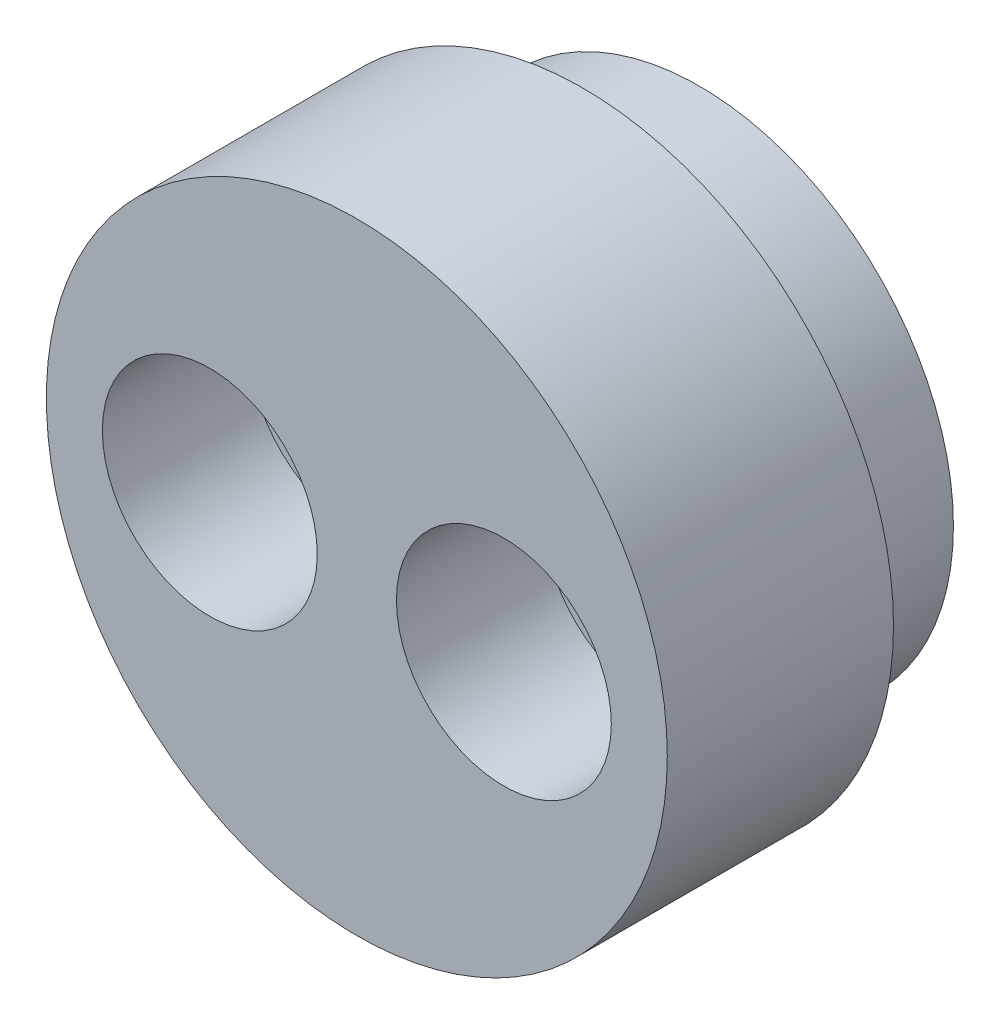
ISO-10303-21;
HEADER;
FILE_DESCRIPTION(('STEP AP214'),'2;1');
FILE_NAME('part.step','',(''),(''),'','','');
FILE_SCHEMA(('AUTOMOTIVE_DESIGN { 1 0 10303 214 1 1 1 1 }'));
ENDSEC;
DATA;
#1=APPLICATION_CONTEXT('core data for automotive mechanical design processes');
#2=APPLICATION_PROTOCOL_DEFINITION('international standard','automotive_design',2000,#1);
#3=PRODUCT_CONTEXT('',#1,'mechanical');
#4=PRODUCT('Part','Part','',(#3));
#5=PRODUCT_RELATED_PRODUCT_CATEGORY('part','',(#4));
#6=PRODUCT_DEFINITION_FORMATION('','',#4);
#7=PRODUCT_DEFINITION_CONTEXT('part definition',#1,'design');
#8=PRODUCT_DEFINITION('design','',#6,#7);
#9=PRODUCT_DEFINITION_SHAPE('','',#8);
#10=(LENGTH_UNIT() NAMED_UNIT(*) SI_UNIT(.MILLI.,.METRE.));
#11=(NAMED_UNIT(*) PLANE_ANGLE_UNIT() SI_UNIT($,.RADIAN.));
#12=(NAMED_UNIT(*) SI_UNIT($,.STERADIAN.) SOLID_ANGLE_UNIT());
#13=UNCERTAINTY_MEASURE_WITH_UNIT(LENGTH_MEASURE(1.E-05),#10,'distance_accuracy_value','');
#14=(GEOMETRIC_REPRESENTATION_CONTEXT(3) GLOBAL_UNCERTAINTY_ASSIGNED_CONTEXT((#13)) GLOBAL_UNIT_ASSIGNED_CONTEXT((#10,
#11,#12)) REPRESENTATION_CONTEXT('',''));
#15=CARTESIAN_POINT('',(0.,0.,0.));
#16=DIRECTION('',(0.,0.,1.));
#17=DIRECTION('',(1.,0.,0.));
#18=AXIS2_PLACEMENT_3D('',#15,#16,#17);
#19=CARTESIAN_POINT('',(0.,0.,10.3));
#20=DIRECTION('',(0.,0.,1.));
#21=DIRECTION('',(1.,0.,0.));
#22=AXIS2_PLACEMENT_3D('',#19,#20,#21);
#23=CYLINDRICAL_SURFACE('',#22,27.45);
#24=CARTESIAN_POINT('',(0.,0.,30.3));
#25=DIRECTION('',(0.,0.,1.));
#26=DIRECTION('',(1.,0.,0.));
#27=AXIS2_PLACEMENT_3D('',#24,#25,#26);
#28=CIRCLE('',#27,27.45);
#29=CARTESIAN_POINT('',(27.45,0.,30.3));
#30=VERTEX_POINT('',#29);
#31=EDGE_CURVE('E48',#30,#30,#28,.F.);
#32=ORIENTED_EDGE('',*,*,#31,.T.);
#33=EDGE_LOOP('',(#32));
#34=FACE_BOUND('',#33,.T.);
#35=CARTESIAN_POINT('',(0.,0.,10.3));
#36=DIRECTION('',(0.,0.,1.));
#37=DIRECTION('',(1.,0.,0.));
#38=AXIS2_PLACEMENT_3D('',#35,#36,#37);
#39=CIRCLE('',#38,27.45);
#40=CARTESIAN_POINT('',(27.45,0.,10.3));
#41=VERTEX_POINT('',#40);
#42=EDGE_CURVE('E16',#41,#41,#39,.T.);
#43=ORIENTED_EDGE('',*,*,#42,.T.);
#44=EDGE_LOOP('',(#43));
#45=FACE_BOUND('',#44,.T.);
#46=ADVANCED_FACE('F12',(#34,#45),#23,.T.);
#47=CARTESIAN_POINT('',(-13.,0.,17.3));
#48=DIRECTION('',(0.,0.,1.));
#49=DIRECTION('',(1.,0.,0.));
#50=AXIS2_PLACEMENT_3D('',#47,#48,#49);
#51=CYLINDRICAL_SURFACE('',#50,9.5);
#52=CARTESIAN_POINT('',(-13.,0.,17.3));
#53=DIRECTION('',(0.,0.,1.));
#54=DIRECTION('',(1.,0.,0.));
#55=AXIS2_PLACEMENT_3D('',#52,#53,#54);
#56=CIRCLE('',#55,9.5);
#57=CARTESIAN_POINT('',(-3.5,0.,17.3));
#58=VERTEX_POINT('',#57);
#59=EDGE_CURVE('E50',#58,#58,#56,.F.);
#60=ORIENTED_EDGE('',*,*,#59,.T.);
#61=EDGE_LOOP('',(#60));
#62=FACE_BOUND('',#61,.T.);
#63=CARTESIAN_POINT('',(-13.,0.,30.3));
#64=DIRECTION('',(0.,0.,1.));
#65=DIRECTION('',(1.,0.,0.));
#66=AXIS2_PLACEMENT_3D('',#63,#64,#65);
#67=CIRCLE('',#66,9.5);
#68=CARTESIAN_POINT('',(-3.5,0.,30.3));
#69=VERTEX_POINT('',#68);
#70=EDGE_CURVE('E45',#69,#69,#67,.T.);
#71=ORIENTED_EDGE('',*,*,#70,.T.);
#72=EDGE_LOOP('',(#71));
#73=FACE_BOUND('',#72,.T.);
#74=ADVANCED_FACE('F61',(#62,#73),#51,.F.);
#75=CARTESIAN_POINT('',(-27.7794,27.7794,10.3));
#76=DIRECTION('',(0.,0.,1.));
#77=DIRECTION('',(0.,-1.,0.));
#78=AXIS2_PLACEMENT_3D('',#75,#76,#77);
#79=PLANE('',#78);
#80=CARTESIAN_POINT('',(0.,0.,10.3));
#81=DIRECTION('',(0.,0.,1.));
#82=DIRECTION('',(1.,0.,0.));
#83=AXIS2_PLACEMENT_3D('',#80,#81,#82);
#84=CIRCLE('',#83,22.45);
#85=CARTESIAN_POINT('',(22.45,0.,10.3));
#86=VERTEX_POINT('',#85);
#87=EDGE_CURVE('E42',#86,#86,#84,.T.);
#88=ORIENTED_EDGE('',*,*,#87,.T.);
#89=EDGE_LOOP('',(#88));
#90=FACE_BOUND('',#89,.T.);
#91=ORIENTED_EDGE('',*,*,#42,.F.);
#92=EDGE_LOOP('',(#91));
#93=FACE_BOUND('',#92,.T.);
#94=ADVANCED_FACE('F58',(#90,#93),#79,.F.);
#95=CARTESIAN_POINT('',(-3.386,-9.614,17.3));
#96=DIRECTION('',(0.,0.,-1.));
#97=DIRECTION('',(-1.,0.,0.));
#98=AXIS2_PLACEMENT_3D('',#95,#96,#97);
#99=PLANE('',#98);
#100=CARTESIAN_POINT('',(-13.,0.,17.3));
#101=DIRECTION('',(0.,0.,1.));
#102=DIRECTION('',(1.,0.,0.));
#103=AXIS2_PLACEMENT_3D('',#100,#101,#102);
#104=CIRCLE('',#103,6.25);
#105=CARTESIAN_POINT('',(-6.75,0.,17.3));
#106=VERTEX_POINT('',#105);
#107=EDGE_CURVE('E39',#106,#106,#104,.T.);
#108=ORIENTED_EDGE('',*,*,#107,.F.);
#109=EDGE_LOOP('',(#108));
#110=FACE_BOUND('',#109,.T.);
#111=ORIENTED_EDGE('',*,*,#59,.F.);
#112=EDGE_LOOP('',(#111));
#113=FACE_BOUND('',#112,.T.);
#114=ADVANCED_FACE('F60',(#110,#113),#99,.F.);
#115=CARTESIAN_POINT('',(-27.7794,-27.7794,30.3));
#116=DIRECTION('',(0.,0.,-1.));
#117=DIRECTION('',(0.,1.,0.));
#118=AXIS2_PLACEMENT_3D('',#115,#116,#117);
#119=PLANE('',#118);
#120=ORIENTED_EDGE('',*,*,#70,.F.);
#121=EDGE_LOOP('',(#120));
#122=FACE_BOUND('',#121,.T.);
#123=CARTESIAN_POINT('',(13.,0.,30.3));
#124=DIRECTION('',(0.,0.,1.));
#125=DIRECTION('',(1.,0.,0.));
#126=AXIS2_PLACEMENT_3D('',#123,#124,#125);
#127=CIRCLE('',#126,9.5);
#128=CARTESIAN_POINT('',(22.5,0.,30.3));
#129=VERTEX_POINT('',#128);
#130=EDGE_CURVE('E36',#129,#129,#127,.T.);
#131=ORIENTED_EDGE('',*,*,#130,.F.);
#132=EDGE_LOOP('',(#131));
#133=FACE_BOUND('',#132,.T.);
#134=ORIENTED_EDGE('',*,*,#31,.F.);
#135=EDGE_LOOP('',(#134));
#136=FACE_BOUND('',#135,.T.);
#137=ADVANCED_FACE('F70',(#122,#133,#136),#119,.F.);
#138=CARTESIAN_POINT('',(0.,0.,0.));
#139=DIRECTION('',(0.,0.,1.));
#140=DIRECTION('',(1.,0.,0.));
#141=AXIS2_PLACEMENT_3D('',#138,#139,#140);
#142=CYLINDRICAL_SURFACE('',#141,22.45);
#143=ORIENTED_EDGE('',*,*,#87,.F.);
#144=EDGE_LOOP('',(#143));
#145=FACE_BOUND('',#144,.T.);
#146=CARTESIAN_POINT('',(0.,0.,0.));
#147=DIRECTION('',(0.,0.,1.));
#148=DIRECTION('',(1.,0.,0.));
#149=AXIS2_PLACEMENT_3D('',#146,#147,#148);
#150=CIRCLE('',#149,22.45);
#151=CARTESIAN_POINT('',(22.45,0.,0.));
#152=VERTEX_POINT('',#151);
#153=EDGE_CURVE('E33',#152,#152,#150,.T.);
#154=ORIENTED_EDGE('',*,*,#153,.T.);
#155=EDGE_LOOP('',(#154));
#156=FACE_BOUND('',#155,.T.);
#157=ADVANCED_FACE('F92',(#145,#156),#142,.T.);
#158=CARTESIAN_POINT('',(-13.,0.,0.));
#159=DIRECTION('',(0.,0.,1.));
#160=DIRECTION('',(1.,0.,0.));
#161=AXIS2_PLACEMENT_3D('',#158,#159,#160);
#162=CYLINDRICAL_SURFACE('',#161,6.25);
#163=CARTESIAN_POINT('',(-13.,0.,0.));
#164=DIRECTION('',(0.,0.,1.));
#165=DIRECTION('',(1.,0.,0.));
#166=AXIS2_PLACEMENT_3D('',#163,#164,#165);
#167=CIRCLE('',#166,6.25);
#168=CARTESIAN_POINT('',(-6.75,0.,0.));
#169=VERTEX_POINT('',#168);
#170=EDGE_CURVE('E30',#169,#169,#167,.F.);
#171=ORIENTED_EDGE('',*,*,#170,.T.);
#172=EDGE_LOOP('',(#171));
#173=FACE_BOUND('',#172,.T.);
#174=ORIENTED_EDGE('',*,*,#107,.T.);
#175=EDGE_LOOP('',(#174));
#176=FACE_BOUND('',#175,.T.);
#177=ADVANCED_FACE('F88',(#173,#176),#162,.F.);
#178=CARTESIAN_POINT('',(13.,0.,17.3));
#179=DIRECTION('',(0.,0.,1.));
#180=DIRECTION('',(1.,0.,0.));
#181=AXIS2_PLACEMENT_3D('',#178,#179,#180);
#182=CYLINDRICAL_SURFACE('',#181,9.5);
#183=CARTESIAN_POINT('',(13.,0.,17.3));
#184=DIRECTION('',(0.,0.,1.));
#185=DIRECTION('',(1.,0.,0.));
#186=AXIS2_PLACEMENT_3D('',#183,#184,#185);
#187=CIRCLE('',#186,9.5);
#188=CARTESIAN_POINT('',(22.5,0.,17.3));
#189=VERTEX_POINT('',#188);
#190=EDGE_CURVE('E25',#189,#189,#187,.F.);
#191=ORIENTED_EDGE('',*,*,#190,.T.);
#192=EDGE_LOOP('',(#191));
#193=FACE_BOUND('',#192,.T.);
#194=ORIENTED_EDGE('',*,*,#130,.T.);
#195=EDGE_LOOP('',(#194));
#196=FACE_BOUND('',#195,.T.);
#197=ADVANCED_FACE('F85',(#193,#196),#182,.F.);
#198=CARTESIAN_POINT('',(-22.7194,22.7194,0.));
#199=DIRECTION('',(0.,0.,1.));
#200=DIRECTION('',(0.,-1.,0.));
#201=AXIS2_PLACEMENT_3D('',#198,#199,#200);
#202=PLANE('',#201);
#203=ORIENTED_EDGE('',*,*,#170,.F.);
#204=EDGE_LOOP('',(#203));
#205=FACE_BOUND('',#204,.T.);
#206=CARTESIAN_POINT('',(13.,0.,0.));
#207=DIRECTION('',(0.,0.,1.));
#208=DIRECTION('',(1.,0.,0.));
#209=AXIS2_PLACEMENT_3D('',#206,#207,#208);
#210=CIRCLE('',#209,6.25);
#211=CARTESIAN_POINT('',(19.25,0.,0.));
#212=VERTEX_POINT('',#211);
#213=EDGE_CURVE('E20',#212,#212,#210,.F.);
#214=ORIENTED_EDGE('',*,*,#213,.F.);
#215=EDGE_LOOP('',(#214));
#216=FACE_BOUND('',#215,.T.);
#217=ORIENTED_EDGE('',*,*,#153,.F.);
#218=EDGE_LOOP('',(#217));
#219=FACE_BOUND('',#218,.T.);
#220=ADVANCED_FACE('F81',(#205,#216,#219),#202,.F.);
#221=CARTESIAN_POINT('',(22.614,-9.614,17.3));
#222=DIRECTION('',(0.,0.,-1.));
#223=DIRECTION('',(-1.,0.,0.));
#224=AXIS2_PLACEMENT_3D('',#221,#222,#223);
#225=PLANE('',#224);
#226=CARTESIAN_POINT('',(13.,0.,17.3));
#227=DIRECTION('',(0.,0.,1.));
#228=DIRECTION('',(1.,0.,0.));
#229=AXIS2_PLACEMENT_3D('',#226,#227,#228);
#230=CIRCLE('',#229,6.25);
#231=CARTESIAN_POINT('',(19.25,0.,17.3));
#232=VERTEX_POINT('',#231);
#233=EDGE_CURVE('E8',#232,#232,#230,.T.);
#234=ORIENTED_EDGE('',*,*,#233,.F.);
#235=EDGE_LOOP('',(#234));
#236=FACE_BOUND('',#235,.T.);
#237=ORIENTED_EDGE('',*,*,#190,.F.);
#238=EDGE_LOOP('',(#237));
#239=FACE_BOUND('',#238,.T.);
#240=ADVANCED_FACE('F14',(#236,#239),#225,.F.);
#241=CARTESIAN_POINT('',(13.,0.,0.));
#242=DIRECTION('',(0.,0.,1.));
#243=DIRECTION('',(1.,0.,0.));
#244=AXIS2_PLACEMENT_3D('',#241,#242,#243);
#245=CYLINDRICAL_SURFACE('',#244,6.25);
#246=ORIENTED_EDGE('',*,*,#233,.T.);
#247=EDGE_LOOP('',(#246));
#248=FACE_BOUND('',#247,.T.);
#249=ORIENTED_EDGE('',*,*,#213,.T.);
#250=EDGE_LOOP('',(#249));
#251=FACE_BOUND('',#250,.T.);
#252=ADVANCED_FACE('F75',(#248,#251),#245,.F.);
#253=CLOSED_SHELL('',(#46,#74,#94,#114,#137,#157,#177,#197,#220,#240,#252));
#254=MANIFOLD_SOLID_BREP('B1',#253);
#255=ADVANCED_BREP_SHAPE_REPRESENTATION('',(#18,#254),#14);
#256=SHAPE_DEFINITION_REPRESENTATION(#9,#255);
ENDSEC;
END-ISO-10303-21;
